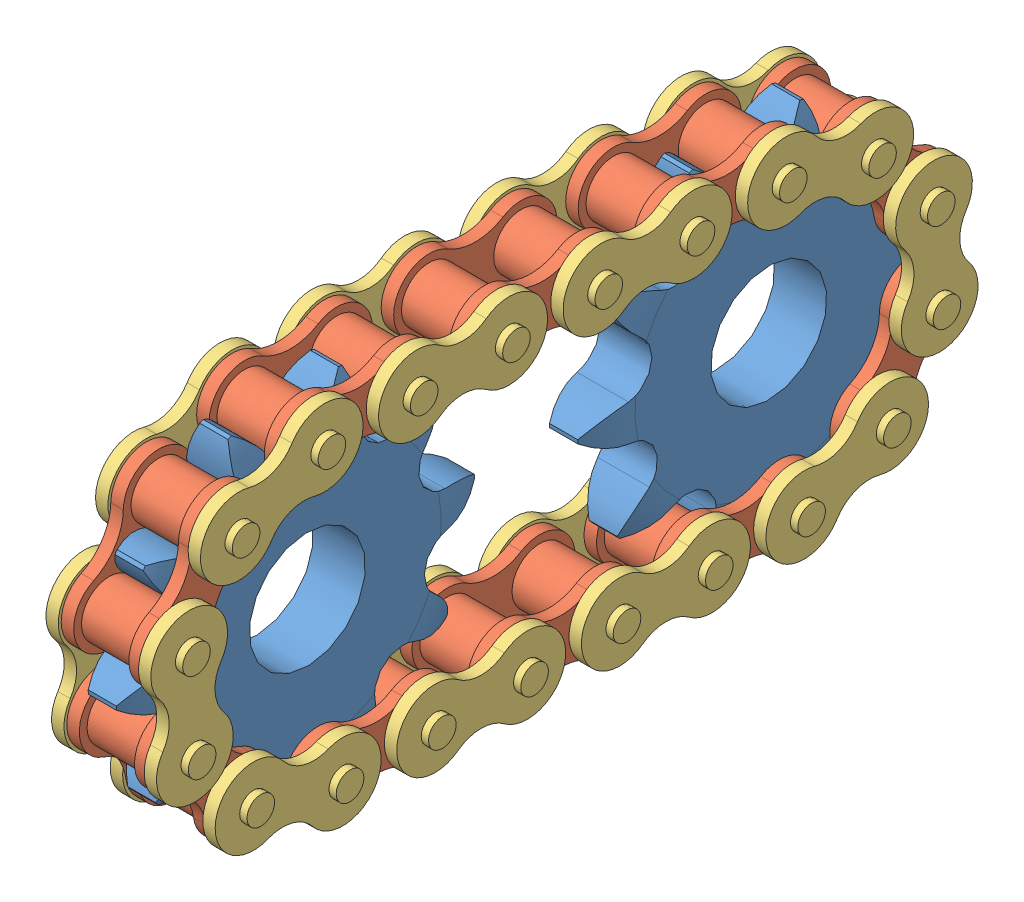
SolidWorks assembly Napęd łańcuchowy 20A1.SLDASM, configuration Domyślna (file format 7000). Lengths in mm.
Overall size (41.1 165.61 360.45).
22 component instances, 3 part files, 64 mates.
Components (placement in the parent):
- Z10-20A1-7: Z10-20A1.SLDPRT [Chain wheel ISO - 10Z 20A-1 --10SA40.0N] at (-8.98 0 0) x (1 0 0) z (0 -0.537479 -0.843277) size (20.7 117.75 123.38)
- Z10-20A1-8: Z10-20A1.SLDPRT [Chain wheel ISO - 10Z 20A-1 --10SA40.0N] at (-8.98 0 158.75) x (1 0 0) z (0 -0.930496 -0.366303) size (20.7 117.75 123.38)
- Ogniwo -W-U-1: Ogniwo -W-U.SLDPRT [Domyślna] at (9.5 18.8467 -47.7905) x (1 0 0) z (0 -0.771376 -0.636379) size (27.6 24.42 56.17)
- Ogniwo -Z-U-1: Ogniwo -Z-U.SLDPRT [Domyślna] at (-18.05 51.3725 3.1311) x (1 0 0) z (0 0.253058 0.967451) size (41.1 33.41 58.15)
- Ogniwo -W-U-2: Ogniwo -W-U.SLDPRT [Domyślna] at (9.5 51.3725 34.8811) size (27.6 24.42 56.17)
- Ogniwo -Z-U-2: Ogniwo -Z-U.SLDPRT [Domyślna] at (-18.05 51.3725 66.6311) size (41.1 33.41 58.15)
- Ogniwo -W-U-3: Ogniwo -W-U.SLDPRT [Domyślna] at (9.5 51.3725 98.3811) size (27.6 24.42 56.17)
- Ogniwo -Z-U-3: Ogniwo -Z-U.SLDPRT [Domyślna] at (-18.05 51.3725 130.1311) size (41.1 33.41 58.15)
- Ogniwo -W-U-4: Ogniwo -W-U.SLDPRT [Domyślna] at (9.5 51.277 161.8809) x (1 0 0) z (0 -0.003008 0.999995) size (27.6 24.42 56.17)
- Ogniwo -Z-U-9: Ogniwo -Z-U.SLDPRT [Domyślna] at (-18.05 18.8467 -47.7905) x (1 0 0) z (0 0.998111 0.061437) size (41.1 33.41 58.15)
- Ogniwo -W-U-7: Ogniwo -W-U.SLDPRT [Domyślna] at (9.5 -12.8433 -49.7412) x (1 0 0) z (0 0.8436 -0.536972) size (27.6 24.42 56.17)
- Ogniwo -Z-U-10: Ogniwo -Z-U.SLDPRT [Domyślna] at (-18.05 -51.2755 -3.156) x (1 0 0) z (0 -0.366862 0.930276) size (41.1 33.41 58.15)
- Ogniwo -W-U-8: Ogniwo -W-U.SLDPRT [Domyślna] at (9.5 -51.3725 28.5938) x (1 0 0) z (0 -0.003056 0.999995) size (27.6 24.42 56.17)
- Ogniwo -Z-U-11: Ogniwo -Z-U.SLDPRT [Domyślna] at (-18.05 -51.3725 60.3438) size (41.1 33.41 58.15)
- Ogniwo -W-U-9: Ogniwo -W-U.SLDPRT [Domyślna] at (9.5 -51.3725 92.0938) size (27.6 24.42 56.17)
- Ogniwo -Z-U-15: Ogniwo -Z-U.SLDPRT [Domyślna] at (-18.05 39.6436 191.4229) x (1 0 0) z (0 -0.366406 0.930455) size (41.1 33.41 58.15)
- Ogniwo -W-U-11: Ogniwo -W-U.SLDPRT [Domyślna] at (9.5 12.8677 208.4849) x (1 0 0) z (0 -0.843337 0.537385) size (27.6 24.42 56.17)
- Ogniwo -Z-U-16: Ogniwo -Z-U.SLDPRT [Domyślna] at (-18.05 -18.8233 206.5498) x (1 0 0) z (0 -0.998141 -0.060948) size (41.1 33.41 58.15)
- Ogniwo -W-U-12: Ogniwo -W-U.SLDPRT [Domyślna] at (9.5 -18.8233 206.5498) x (1 0 0) z (0 0.771688 0.636002) size (27.6 24.42 56.17)
- Ogniwo -Z-U-17: Ogniwo -Z-U.SLDPRT [Domyślna] at (-18.05 -43.3244 186.3567) x (1 0 0) z (0 0.253484 0.96734) size (41.1 33.41 58.15)
- Ogniwo -W-U-13: Ogniwo -W-U.SLDPRT [Domyślna] at (9.5 -51.3725 155.6437) size (27.6 24.42 56.17)
- Ogniwo -Z-U-18: Ogniwo -Z-U.SLDPRT [Domyślna] at (-18.05 -51.3725 123.8937) size (41.1 33.41 58.15)
Mates (geometry in assembly coordinates):
- Wspólnie4: coincident: plane of Z10-20A1-8; plane of assembly through (0 0 0) normal (1 0 0)
- Wspólnie7: coincident: point of Z10-20A1-8; plane of assembly
- Wspólnie8: coincident: plane of Ogniwo -W-U-1; plane of assembly through (0 0 0) normal (1 0 0)
- WiązanieŚcieżki1: path: point of Ogniwo -W-U-1; curve of assembly
- WiązanieŚcieżki2: path: point of Ogniwo -W-U-1; curve of assembly
- Koncentryczne1: concentric: cylinder of Ogniwo -W-U-1 through (13.8 43.3379 -27.5855) axis (-1 0 0) radius 4.765; cylinder of Ogniwo -Z-U-1 through (-20.55 43.3379 -27.5855) axis (1 0 0) radius 4.765
- Wspólnie10: coincident: plane of Ogniwo -W-U-1 through (13.8 33.1892 -52.7026) normal (1 0 0); plane of Ogniwo -Z-U-1 through (13.8 55.6137 -22.5919) normal (-1 0 0)
- WiązanieŚcieżki3: path: point of Ogniwo -Z-U-1; curve of assembly
- Koncentryczne3: concentric: cylinder of Ogniwo -Z-U-1 through (-20.55 51.3725 3.1311) axis (1 0 0) radius 4.765; cylinder of Ogniwo -W-U-2 through (13.8 51.3725 3.1311) axis (-1 0 0) radius 4.765
- Wspólnie12: coincident: plane of Ogniwo -Z-U-1 through (13.8 55.6137 -22.5919) normal (-1 0 0); plane of Ogniwo -W-U-2 through (13.8 38.4562 26.9436) normal (1 0 0)
- WiązanieŚcieżki4: path: point of Ogniwo -W-U-2; curve of assembly
- Wspólnie13: coincident: plane of Ogniwo -W-U-2 through (13.8 38.4562 26.9436) normal (1 0 0); plane of Ogniwo -Z-U-2 through (13.8 61.9851 42.8186) normal (-1 0 0)
- Koncentryczne4: concentric: cylinder of Ogniwo -W-U-2 through (13.8 51.3725 34.8811) axis (-1 0 0) radius 4.765; cylinder of Ogniwo -Z-U-2 through (-20.55 51.3725 34.8811) axis (1 0 0) radius 4.765
- WiązanieŚcieżki5: path: point of Ogniwo -Z-U-2; curve of assembly
- Wspólnie14: coincident: plane of Ogniwo -Z-U-2 through (-13.8 61.9851 42.8186) normal (1 0 0); plane of Ogniwo -W-U-3 through (-13.8 64.2888 90.4436) normal (-1 0 0)
- Koncentryczne5: concentric: cylinder of Ogniwo -Z-U-2 through (-20.55 51.3725 66.6311) axis (1 0 0) radius 4.765; cylinder of Ogniwo -W-U-3 through (13.8 51.3725 66.6311) axis (-1 0 0) radius 4.765
- WiązanieŚcieżki6: path: point of Ogniwo -W-U-3; curve of assembly
- Wspólnie15: coincident: plane of Ogniwo -W-U-3 through (13.8 38.4562 90.4436) normal (1 0 0); plane of Ogniwo -Z-U-3 through (13.8 61.9851 106.3186) normal (-1 0 0)
- Koncentryczne10: concentric: cylinder of Ogniwo -W-U-3 through (13.8 51.3725 98.3811) axis (-1 0 0) radius 4.765; cylinder of Ogniwo -Z-U-3 through (-20.55 51.3725 98.3811) axis (1 0 0) radius 4.765
- WiązanieŚcieżki7: path: point of Ogniwo -Z-U-3; curve of assembly
- Wspólnie16: coincident: plane of Ogniwo -Z-U-3 through (13.8 61.9851 106.3186) normal (-1 0 0); plane of Ogniwo -W-U-4 through (13.8 38.3846 153.9046) normal (1 0 0)
- Koncentryczne11: concentric: cylinder of Ogniwo -Z-U-3 through (-20.55 51.3725 130.1311) axis (1 0 0) radius 4.765; cylinder of Ogniwo -W-U-4 through (13.8 51.3725 130.1311) axis (-1 0 0) radius 4.765
- WiązanieŚcieżki8: path: point of Ogniwo -W-U-4; curve of assembly
- Wiązanie pasa1: belt = 102.745 mm: circle of Z10-20A1-7; circle of Z10-20A1-8
- Wspólnie18: coincident: point of Z10-20A1-7; point of assembly
- Wspólnie19: coincident: plane of Z10-20A1-7; plane of assembly through (0 0 0) normal (1 0 0)
- Odległość1: distance = 158.75 mm: line of Z10-20A1-7 through (8.98 0 0) axis (-1 0 0); line of Z10-20A1-8 through (8.98 0 158.75) axis (-1 0 0)
- WiązanieŚcieżki14: path: point of Ogniwo -Z-U-9; curve of assembly
- Koncentryczne22: concentric: cylinder of Ogniwo -Z-U-9 through (-20.55 -12.8433 -49.7412) axis (1 0 0) radius 4.765; cylinder of Ogniwo -W-U-7 through (13.8 -12.8433 -49.7412) axis (-1 0 0) radius 4.765
- WiązanieŚcieżki17: path: point of Ogniwo -W-U-7; curve of assembly
- Wspólnie31: coincident: plane of Ogniwo -Z-U-9 through (-18.05 -4.2688 -59.846) normal (-1 0 0); plane of Ogniwo -Z-U-10 through (-18.05 -32.667 -21.4149) normal (-1 0 0)
- Koncentryczne23: concentric: cylinder of Ogniwo -W-U-7 through (13.8 -39.6276 -32.6923) axis (-1 0 0) radius 4.765; cylinder of Ogniwo -Z-U-10 through (-20.55 -39.6276 -32.6923) axis (1 0 0) radius 4.765
- WiązanieŚcieżki18: path: point of Ogniwo -Z-U-10; curve of assembly
- Wspólnie32: coincident: plane of Ogniwo -W-U-7 through (-13.8 -26.4751 -56.3751) normal (-1 0 0); plane of Ogniwo -W-U-8 through (-13.8 -38.432 20.6958) normal (-1 0 0)
- Koncentryczne24: concentric: cylinder of Ogniwo -Z-U-10 through (-20.55 -51.2755 -3.156) axis (1 0 0) radius 4.765; cylinder of Ogniwo -W-U-8 through (13.8 -51.2755 -3.156) axis (-1 0 0) radius 4.765
- WiązanieŚcieżki19: path: point of Ogniwo -W-U-8; curve of assembly
- Wspólnie34: coincident: plane of Ogniwo -Z-U-10 through (-18.05 -32.667 -21.4149) normal (-1 0 0); plane of Ogniwo -Z-U-11 through (-18.05 -40.7599 36.5313) normal (-1 0 0)
- Koncentryczne26: concentric: cylinder of Ogniwo -W-U-8 through (13.8 -51.3725 28.5938) axis (-1 0 0) radius 4.765; cylinder of Ogniwo -Z-U-11 through (-20.55 -51.3725 28.5938) axis (1 0 0) radius 4.765
- WiązanieŚcieżki21: path: point of Ogniwo -Z-U-11; curve of assembly
- Wspólnie35: coincident: plane of Ogniwo -W-U-8 through (-13.8 -38.432 20.6958) normal (-1 0 0); plane of Ogniwo -W-U-9 through (-13.8 -38.4562 84.1563) normal (-1 0 0)
- Koncentryczne27: concentric: cylinder of Ogniwo -Z-U-11 through (-20.55 -51.3725 60.3438) axis (1 0 0) radius 4.765; cylinder of Ogniwo -W-U-9 through (13.8 -51.3725 60.3438) axis (-1 0 0) radius 4.765
- WiązanieŚcieżki22: path: point of Ogniwo -W-U-9; curve of assembly
- Wspólnie42: coincident: plane of Ogniwo -Z-U-3 through (-18.05 61.9851 106.3186) normal (-1 0 0); plane of Ogniwo -Z-U-15 through (-18.05 58.2432 173.1549) normal (-1 0 0)
- Koncentryczne34: concentric: cylinder of Ogniwo -W-U-4 through (13.8 51.277 161.8809) axis (-1 0 0) radius 4.765; cylinder of Ogniwo -Z-U-15 through (-20.55 51.277 161.8809) axis (1 0 0) radius 4.765
- WiązanieŚcieżki26: path: point of Ogniwo -Z-U-15; curve of assembly
- Wspólnie43: coincident: plane of Ogniwo -W-U-4 through (-13.8 64.2171 153.9823) normal (-1 0 0); plane of Ogniwo -W-U-11 through (-13.8 26.5027 215.1122) normal (-1 0 0)
- Koncentryczne35: concentric: cylinder of Ogniwo -Z-U-15 through (-20.55 39.6436 191.4229) axis (1 0 0) radius 4.765; cylinder of Ogniwo -W-U-11 through (13.8 39.6436 191.4229) axis (-1 0 0) radius 4.765
- WiązanieŚcieżki27: path: point of Ogniwo -W-U-11; curve of assembly
- Wspólnie44: coincident: plane of Ogniwo -Z-U-15 through (-18.05 58.2432 173.1549) normal (-1 0 0); plane of Ogniwo -Z-U-16 through (-18.05 4.2981 218.5939) normal (-1 0 0)
- Koncentryczne36: concentric: cylinder of Ogniwo -W-U-11 through (13.8 12.8677 208.4849) axis (-1 0 0) radius 4.765; cylinder of Ogniwo -Z-U-16 through (-20.55 12.8677 208.4849) axis (1 0 0) radius 4.765
- WiązanieŚcieżki28: path: point of Ogniwo -Z-U-16; curve of assembly
- Wspólnie45: coincident: plane of Ogniwo -W-U-9 through (-13.8 -38.4562 84.1563) normal (-1 0 0); plane of Ogniwo -W-U-12 through (-13.8 -16.7338 191.5341) normal (-1 0 0)
- Koncentryczne38: concentric: cylinder of Ogniwo -Z-U-16 through (-20.55 -18.8233 206.5498) axis (1 0 0) radius 4.765; cylinder of Ogniwo -W-U-12 through (13.8 -18.8233 206.5498) axis (-1 0 0) radius 4.765
- WiązanieŚcieżki29: path: point of Ogniwo -W-U-12; curve of assembly
- Koncentryczne39: concentric: cylinder of Ogniwo -W-U-1 through (-9.5 18.8467 -47.7905) axis (1 0 0) radius 9.525; cylinder of Ogniwo -Z-U-9 through (-20.55 18.8467 -47.7905) axis (1 0 0) radius 4.765
- Wspólnie46: coincident: plane of Ogniwo -Z-U-11 through (-18.05 -40.7599 36.5313) normal (-1 0 0); plane of Ogniwo -Z-U-17 through (-18.05 -39.0945 160.6318) normal (-1 0 0)
- Koncentryczne40: concentric: cylinder of Ogniwo -W-U-12 through (13.8 -43.3244 186.3567) axis (-1 0 0) radius 4.765; cylinder of Ogniwo -Z-U-17 through (-20.55 -43.3244 186.3567) axis (1 0 0) radius 4.765
- WiązanieŚcieżki30: path: point of Ogniwo -Z-U-17; curve of assembly
- Wspólnie47: coincident: plane of Ogniwo -W-U-9 through (-13.8 -38.4562 84.1563) normal (-1 0 0); plane of Ogniwo -W-U-13 through (-13.8 -38.4562 147.7062) normal (-1 0 0)
- Koncentryczne41: concentric: cylinder of Ogniwo -Z-U-17 through (-20.55 -51.3725 155.6437) axis (1 0 0) radius 4.765; cylinder of Ogniwo -W-U-13 through (13.8 -51.3725 155.6437) axis (-1 0 0) radius 4.765
- WiązanieŚcieżki31: path: point of Ogniwo -W-U-13; curve of assembly
- Wspólnie48: coincident: plane of Ogniwo -Z-U-17 through (-18.05 -39.0945 160.6318) normal (-1 0 0); plane of Ogniwo -Z-U-18 through (-18.05 -40.7599 100.0812) normal (-1 0 0)
- Koncentryczne42: concentric: cylinder of Ogniwo -W-U-13 through (13.8 -51.3725 123.8937) axis (-1 0 0) radius 4.765; cylinder of Ogniwo -Z-U-18 through (-20.55 -51.3725 123.8937) axis (1 0 0) radius 4.765
- WiązanieŚcieżki32: path: point of Ogniwo -Z-U-18; curve of assembly
